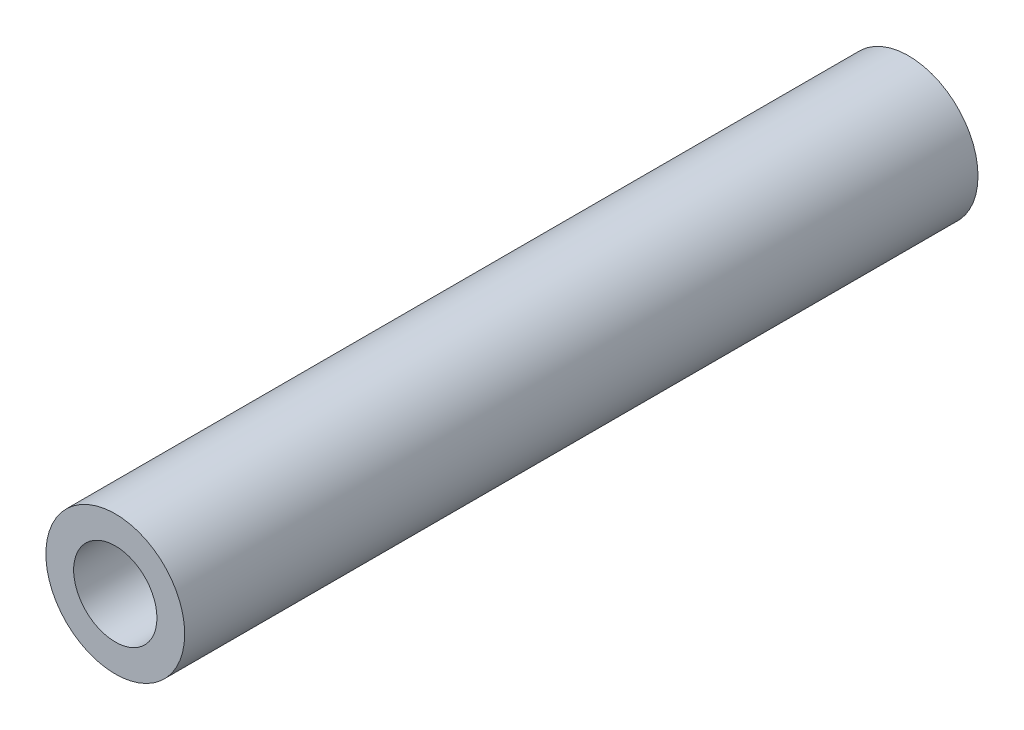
ISO-10303-21;
HEADER;
FILE_DESCRIPTION(('STEP AP214'),'2;1');
FILE_NAME('part.step','',(''),(''),'','','');
FILE_SCHEMA(('AUTOMOTIVE_DESIGN { 1 0 10303 214 1 1 1 1 }'));
ENDSEC;
DATA;
#1=APPLICATION_CONTEXT('core data for automotive mechanical design processes');
#2=APPLICATION_PROTOCOL_DEFINITION('international standard','automotive_design',2000,#1);
#3=PRODUCT_CONTEXT('',#1,'mechanical');
#4=PRODUCT('Part','Part','',(#3));
#5=PRODUCT_RELATED_PRODUCT_CATEGORY('part','',(#4));
#6=PRODUCT_DEFINITION_FORMATION('','',#4);
#7=PRODUCT_DEFINITION_CONTEXT('part definition',#1,'design');
#8=PRODUCT_DEFINITION('design','',#6,#7);
#9=PRODUCT_DEFINITION_SHAPE('','',#8);
#10=(LENGTH_UNIT() NAMED_UNIT(*) SI_UNIT(.MILLI.,.METRE.));
#11=(NAMED_UNIT(*) PLANE_ANGLE_UNIT() SI_UNIT($,.RADIAN.));
#12=(NAMED_UNIT(*) SI_UNIT($,.STERADIAN.) SOLID_ANGLE_UNIT());
#13=UNCERTAINTY_MEASURE_WITH_UNIT(LENGTH_MEASURE(1.E-05),#10,'distance_accuracy_value','');
#14=(GEOMETRIC_REPRESENTATION_CONTEXT(3) GLOBAL_UNCERTAINTY_ASSIGNED_CONTEXT((#13)) GLOBAL_UNIT_ASSIGNED_CONTEXT((#10,
#11,#12)) REPRESENTATION_CONTEXT('',''));
#15=CARTESIAN_POINT('',(0.,0.,0.));
#16=DIRECTION('',(0.,0.,1.));
#17=DIRECTION('',(1.,0.,0.));
#18=AXIS2_PLACEMENT_3D('',#15,#16,#17);
#19=CARTESIAN_POINT('',(-93.2394907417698,27.2898067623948,40.));
#20=DIRECTION('',(0.,0.,1.));
#21=DIRECTION('',(1.,0.,0.));
#22=AXIS2_PLACEMENT_3D('',#19,#20,#21);
#23=PLANE('',#22);
#24=CARTESIAN_POINT('',(-93.2394907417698,27.2898067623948,40.));
#25=DIRECTION('',(0.,0.,1.));
#26=DIRECTION('',(1.,0.,0.));
#27=AXIS2_PLACEMENT_3D('',#24,#25,#26);
#28=CIRCLE('',#27,3.50000000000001);
#29=CARTESIAN_POINT('',(-89.7394907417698,27.2898067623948,40.));
#30=VERTEX_POINT('',#29);
#31=EDGE_CURVE('E10',#30,#30,#28,.T.);
#32=ORIENTED_EDGE('',*,*,#31,.T.);
#33=EDGE_LOOP('',(#32));
#34=FACE_BOUND('',#33,.T.);
#35=CARTESIAN_POINT('',(-93.2394907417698,27.2898067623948,40.));
#36=DIRECTION('',(0.,0.,1.));
#37=DIRECTION('',(1.,0.,0.));
#38=AXIS2_PLACEMENT_3D('',#35,#36,#37);
#39=CIRCLE('',#38,2.1);
#40=CARTESIAN_POINT('',(-91.1394907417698,27.2898067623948,40.));
#41=VERTEX_POINT('',#40);
#42=EDGE_CURVE('E48',#41,#41,#39,.T.);
#43=ORIENTED_EDGE('',*,*,#42,.F.);
#44=EDGE_LOOP('',(#43));
#45=FACE_BOUND('',#44,.T.);
#46=ADVANCED_FACE('F37',(#34,#45),#23,.T.);
#47=CARTESIAN_POINT('',(-93.2394907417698,27.2898067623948,0.));
#48=DIRECTION('',(0.,0.,1.));
#49=DIRECTION('',(1.,0.,0.));
#50=AXIS2_PLACEMENT_3D('',#47,#48,#49);
#51=PLANE('',#50);
#52=CARTESIAN_POINT('',(-93.2394907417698,27.2898067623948,0.));
#53=DIRECTION('',(0.,0.,1.));
#54=DIRECTION('',(1.,0.,0.));
#55=AXIS2_PLACEMENT_3D('',#52,#53,#54);
#56=CIRCLE('',#55,3.50000000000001);
#57=CARTESIAN_POINT('',(-89.7394907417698,27.2898067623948,0.));
#58=VERTEX_POINT('',#57);
#59=EDGE_CURVE('E41',#58,#58,#56,.T.);
#60=ORIENTED_EDGE('',*,*,#59,.F.);
#61=EDGE_LOOP('',(#60));
#62=FACE_BOUND('',#61,.T.);
#63=CARTESIAN_POINT('',(-93.2394907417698,27.2898067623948,0.));
#64=DIRECTION('',(0.,0.,1.));
#65=DIRECTION('',(1.,0.,0.));
#66=AXIS2_PLACEMENT_3D('',#63,#64,#65);
#67=CIRCLE('',#66,2.1);
#68=CARTESIAN_POINT('',(-91.1394907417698,27.2898067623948,0.));
#69=VERTEX_POINT('',#68);
#70=EDGE_CURVE('E50',#69,#69,#67,.T.);
#71=ORIENTED_EDGE('',*,*,#70,.T.);
#72=EDGE_LOOP('',(#71));
#73=FACE_BOUND('',#72,.T.);
#74=ADVANCED_FACE('F60',(#62,#73),#51,.F.);
#75=CARTESIAN_POINT('',(-93.2394907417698,27.2898067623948,40.));
#76=DIRECTION('',(0.,0.,-1.));
#77=DIRECTION('',(-1.,0.,0.));
#78=AXIS2_PLACEMENT_3D('',#75,#76,#77);
#79=CYLINDRICAL_SURFACE('',#78,3.50000000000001);
#80=ORIENTED_EDGE('',*,*,#31,.F.);
#81=EDGE_LOOP('',(#80));
#82=FACE_BOUND('',#81,.T.);
#83=ORIENTED_EDGE('',*,*,#59,.T.);
#84=EDGE_LOOP('',(#83));
#85=FACE_BOUND('',#84,.T.);
#86=ADVANCED_FACE('F39',(#82,#85),#79,.T.);
#87=CARTESIAN_POINT('',(-93.2394907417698,27.2898067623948,40.));
#88=DIRECTION('',(0.,0.,-1.));
#89=DIRECTION('',(-1.,0.,0.));
#90=AXIS2_PLACEMENT_3D('',#87,#88,#89);
#91=CYLINDRICAL_SURFACE('',#90,2.1);
#92=ORIENTED_EDGE('',*,*,#42,.T.);
#93=EDGE_LOOP('',(#92));
#94=FACE_BOUND('',#93,.T.);
#95=ORIENTED_EDGE('',*,*,#70,.F.);
#96=EDGE_LOOP('',(#95));
#97=FACE_BOUND('',#96,.T.);
#98=ADVANCED_FACE('F56',(#94,#97),#91,.F.);
#99=CLOSED_SHELL('',(#46,#74,#86,#98));
#100=MANIFOLD_SOLID_BREP('B2',#99);
#101=ADVANCED_BREP_SHAPE_REPRESENTATION('',(#18,#100),#14);
#102=SHAPE_DEFINITION_REPRESENTATION(#9,#101);
ENDSEC;
END-ISO-10303-21;
